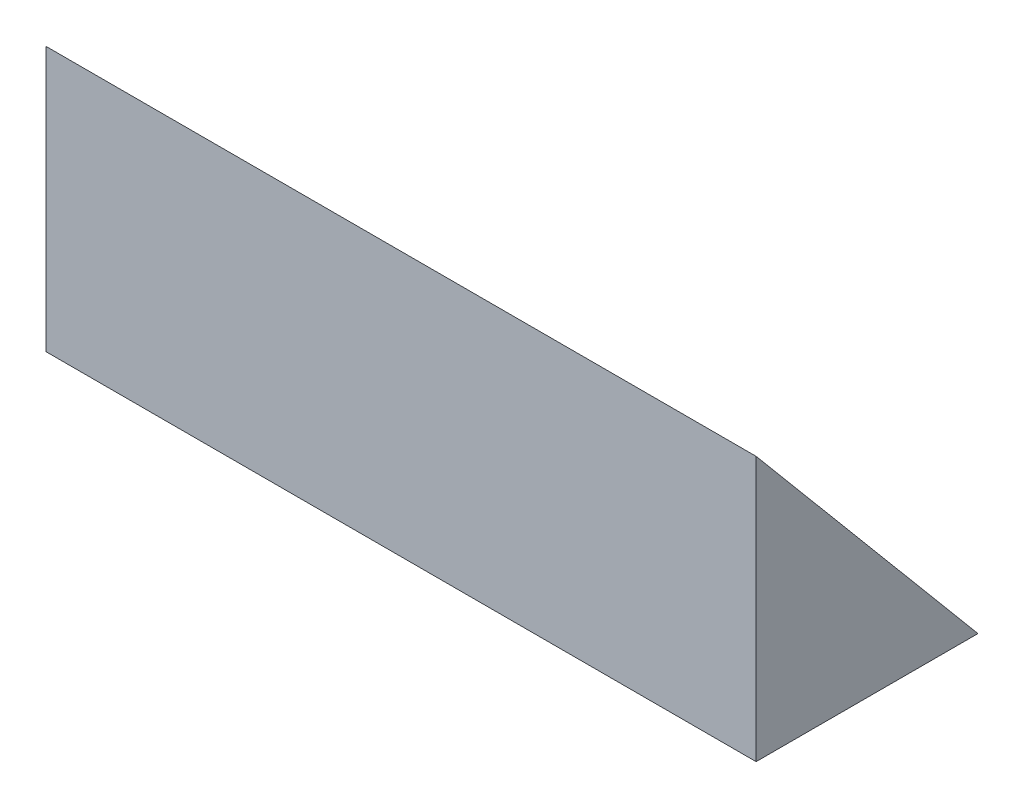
ISO-10303-21;
HEADER;
FILE_DESCRIPTION(('STEP AP214'),'2;1');
FILE_NAME('part.step','',(''),(''),'','','');
FILE_SCHEMA(('AUTOMOTIVE_DESIGN { 1 0 10303 214 1 1 1 1 }'));
ENDSEC;
DATA;
#1=APPLICATION_CONTEXT('core data for automotive mechanical design processes');
#2=APPLICATION_PROTOCOL_DEFINITION('international standard','automotive_design',2000,#1);
#3=PRODUCT_CONTEXT('',#1,'mechanical');
#4=PRODUCT('Part','Part','',(#3));
#5=PRODUCT_RELATED_PRODUCT_CATEGORY('part','',(#4));
#6=PRODUCT_DEFINITION_FORMATION('','',#4);
#7=PRODUCT_DEFINITION_CONTEXT('part definition',#1,'design');
#8=PRODUCT_DEFINITION('design','',#6,#7);
#9=PRODUCT_DEFINITION_SHAPE('','',#8);
#10=(LENGTH_UNIT() NAMED_UNIT(*) SI_UNIT(.MILLI.,.METRE.));
#11=(NAMED_UNIT(*) PLANE_ANGLE_UNIT() SI_UNIT($,.RADIAN.));
#12=(NAMED_UNIT(*) SI_UNIT($,.STERADIAN.) SOLID_ANGLE_UNIT());
#13=UNCERTAINTY_MEASURE_WITH_UNIT(LENGTH_MEASURE(1.E-05),#10,'distance_accuracy_value','');
#14=(GEOMETRIC_REPRESENTATION_CONTEXT(3) GLOBAL_UNCERTAINTY_ASSIGNED_CONTEXT((#13)) GLOBAL_UNIT_ASSIGNED_CONTEXT((#10,
#11,#12)) REPRESENTATION_CONTEXT('',''));
#15=CARTESIAN_POINT('',(0.,0.,0.));
#16=DIRECTION('',(0.,0.,1.));
#17=DIRECTION('',(1.,0.,0.));
#18=AXIS2_PLACEMENT_3D('',#15,#16,#17);
#19=CARTESIAN_POINT('',(1600.,0.,0.));
#20=DIRECTION('',(0.,0.,-1.));
#21=DIRECTION('',(-1.,0.,0.));
#22=AXIS2_PLACEMENT_3D('',#19,#20,#21);
#23=PLANE('',#22);
#24=DIRECTION('',(0.,-1.,0.));
#25=VECTOR('',#24,1.);
#26=CARTESIAN_POINT('',(0.,0.,0.));
#27=LINE('',#26,#25);
#28=CARTESIAN_POINT('',(0.,595.876796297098,0.));
#29=VERTEX_POINT('',#28);
#30=CARTESIAN_POINT('',(0.,0.,0.));
#31=VERTEX_POINT('',#30);
#32=EDGE_CURVE('E79',#29,#31,#27,.T.);
#33=ORIENTED_EDGE('',*,*,#32,.T.);
#34=DIRECTION('',(-1.,0.,0.));
#35=VECTOR('',#34,1.);
#36=CARTESIAN_POINT('',(1600.,0.,0.));
#37=LINE('',#36,#35);
#38=CARTESIAN_POINT('',(1600.,0.,0.));
#39=VERTEX_POINT('',#38);
#40=EDGE_CURVE('E11',#39,#31,#37,.T.);
#41=ORIENTED_EDGE('',*,*,#40,.F.);
#42=DIRECTION('',(0.,-1.,0.));
#43=VECTOR('',#42,1.);
#44=CARTESIAN_POINT('',(1600.,0.,0.));
#45=LINE('',#44,#43);
#46=CARTESIAN_POINT('',(1600.,595.876796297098,0.));
#47=VERTEX_POINT('',#46);
#48=EDGE_CURVE('E72',#47,#39,#45,.T.);
#49=ORIENTED_EDGE('',*,*,#48,.F.);
#50=DIRECTION('',(-1.,0.,0.));
#51=VECTOR('',#50,1.);
#52=CARTESIAN_POINT('',(1600.,595.876796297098,0.));
#53=LINE('',#52,#51);
#54=EDGE_CURVE('E80',#47,#29,#53,.T.);
#55=ORIENTED_EDGE('',*,*,#54,.T.);
#56=EDGE_LOOP('',(#33,#41,#49,#55));
#57=FACE_BOUND('',#56,.T.);
#58=ADVANCED_FACE('F32',(#57),#23,.F.);
#59=CARTESIAN_POINT('',(1600.,0.,0.));
#60=DIRECTION('',(0.,1.,0.));
#61=DIRECTION('',(0.,0.,1.));
#62=AXIS2_PLACEMENT_3D('',#59,#60,#61);
#63=PLANE('',#62);
#64=CARTESIAN_POINT('',(1050.,0.,-250.));
#65=DIRECTION('',(0.,-1.,0.));
#66=DIRECTION('',(0.,0.,1.));
#67=AXIS2_PLACEMENT_3D('',#64,#65,#66);
#68=CIRCLE('',#67,5.00000000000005);
#69=CARTESIAN_POINT('',(1050.,0.,-245.));
#70=VERTEX_POINT('',#69);
#71=EDGE_CURVE('E116',#70,#70,#68,.T.);
#72=ORIENTED_EDGE('',*,*,#71,.F.);
#73=EDGE_LOOP('',(#72));
#74=FACE_BOUND('',#73,.T.);
#75=CARTESIAN_POINT('',(550.,0.,-250.));
#76=DIRECTION('',(0.,-1.,0.));
#77=DIRECTION('',(0.,0.,-1.));
#78=AXIS2_PLACEMENT_3D('',#75,#76,#77);
#79=CIRCLE('',#78,5.00000000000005);
#80=CARTESIAN_POINT('',(550.,0.,-255.));
#81=VERTEX_POINT('',#80);
#82=EDGE_CURVE('E86',#81,#81,#79,.T.);
#83=ORIENTED_EDGE('',*,*,#82,.F.);
#84=EDGE_LOOP('',(#83));
#85=FACE_BOUND('',#84,.T.);
#86=DIRECTION('',(0.,0.,-1.));
#87=VECTOR('',#86,1.);
#88=CARTESIAN_POINT('',(0.,0.,0.));
#89=LINE('',#88,#87);
#90=CARTESIAN_POINT('',(0.,0.,-500.));
#91=VERTEX_POINT('',#90);
#92=EDGE_CURVE('E60',#31,#91,#89,.T.);
#93=ORIENTED_EDGE('',*,*,#92,.T.);
#94=DIRECTION('',(-1.,0.,0.));
#95=VECTOR('',#94,1.);
#96=CARTESIAN_POINT('',(1600.,0.,-500.));
#97=LINE('',#96,#95);
#98=CARTESIAN_POINT('',(1600.,0.,-500.));
#99=VERTEX_POINT('',#98);
#100=EDGE_CURVE('E40',#99,#91,#97,.T.);
#101=ORIENTED_EDGE('',*,*,#100,.F.);
#102=DIRECTION('',(0.,0.,-1.));
#103=VECTOR('',#102,1.);
#104=CARTESIAN_POINT('',(1600.,0.,0.));
#105=LINE('',#104,#103);
#106=EDGE_CURVE('E68',#39,#99,#105,.T.);
#107=ORIENTED_EDGE('',*,*,#106,.F.);
#108=ORIENTED_EDGE('',*,*,#40,.T.);
#109=EDGE_LOOP('',(#93,#101,#107,#108));
#110=FACE_BOUND('',#109,.T.);
#111=ADVANCED_FACE('F69',(#74,#85,#110),#63,.F.);
#112=CARTESIAN_POINT('',(1600.,0.,-500.));
#113=DIRECTION('',(0.,-0.642787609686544,0.766044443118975));
#114=DIRECTION('',(0.,-0.766044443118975,-0.642787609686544));
#115=AXIS2_PLACEMENT_3D('',#112,#113,#114);
#116=PLANE('',#115);
#117=DIRECTION('',(0.,0.766044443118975,0.642787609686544));
#118=VECTOR('',#117,1.);
#119=CARTESIAN_POINT('',(0.,0.,-500.));
#120=LINE('',#119,#118);
#121=EDGE_CURVE('E65',#91,#29,#120,.T.);
#122=ORIENTED_EDGE('',*,*,#121,.T.);
#123=ORIENTED_EDGE('',*,*,#54,.F.);
#124=DIRECTION('',(0.,0.766044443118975,0.642787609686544));
#125=VECTOR('',#124,1.);
#126=CARTESIAN_POINT('',(1600.,0.,-500.));
#127=LINE('',#126,#125);
#128=EDGE_CURVE('E48',#99,#47,#127,.T.);
#129=ORIENTED_EDGE('',*,*,#128,.F.);
#130=ORIENTED_EDGE('',*,*,#100,.T.);
#131=EDGE_LOOP('',(#122,#123,#129,#130));
#132=FACE_BOUND('',#131,.T.);
#133=ADVANCED_FACE('F91',(#132),#116,.F.);
#134=CARTESIAN_POINT('',(1600.,0.,0.));
#135=DIRECTION('',(-1.,0.,0.));
#136=DIRECTION('',(0.,0.,1.));
#137=AXIS2_PLACEMENT_3D('',#134,#135,#136);
#138=PLANE('',#137);
#139=ORIENTED_EDGE('',*,*,#48,.T.);
#140=ORIENTED_EDGE('',*,*,#106,.T.);
#141=ORIENTED_EDGE('',*,*,#128,.T.);
#142=EDGE_LOOP('',(#139,#140,#141));
#143=FACE_BOUND('',#142,.T.);
#144=ADVANCED_FACE('F75',(#143),#138,.F.);
#145=CARTESIAN_POINT('',(0.,0.,0.));
#146=DIRECTION('',(-1.,0.,0.));
#147=DIRECTION('',(0.,0.,1.));
#148=AXIS2_PLACEMENT_3D('',#145,#146,#147);
#149=PLANE('',#148);
#150=ORIENTED_EDGE('',*,*,#32,.F.);
#151=ORIENTED_EDGE('',*,*,#121,.F.);
#152=ORIENTED_EDGE('',*,*,#92,.F.);
#153=EDGE_LOOP('',(#150,#151,#152));
#154=FACE_BOUND('',#153,.T.);
#155=ADVANCED_FACE('F92',(#154),#149,.T.);
#156=CARTESIAN_POINT('',(550.,10.,-250.));
#157=DIRECTION('',(0.,-1.,0.));
#158=DIRECTION('',(0.,0.,-1.));
#159=AXIS2_PLACEMENT_3D('',#156,#157,#158);
#160=CYLINDRICAL_SURFACE('',#159,5.00000000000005);
#161=CARTESIAN_POINT('',(550.,10.,-250.));
#162=DIRECTION('',(0.,-1.,0.));
#163=DIRECTION('',(0.,0.,-1.));
#164=AXIS2_PLACEMENT_3D('',#161,#162,#163);
#165=CIRCLE('',#164,5.00000000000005);
#166=CARTESIAN_POINT('',(550.,10.,-255.));
#167=VERTEX_POINT('',#166);
#168=EDGE_CURVE('E82',#167,#167,#165,.T.);
#169=ORIENTED_EDGE('',*,*,#168,.F.);
#170=EDGE_LOOP('',(#169));
#171=FACE_BOUND('',#170,.T.);
#172=ORIENTED_EDGE('',*,*,#82,.T.);
#173=EDGE_LOOP('',(#172));
#174=FACE_BOUND('',#173,.T.);
#175=ADVANCED_FACE('F94',(#171,#174),#160,.F.);
#176=CARTESIAN_POINT('',(550.,10.,-250.));
#177=DIRECTION('',(0.,-1.,0.));
#178=DIRECTION('',(0.,0.,-1.));
#179=AXIS2_PLACEMENT_3D('',#176,#177,#178);
#180=PLANE('',#179);
#181=ORIENTED_EDGE('',*,*,#168,.T.);
#182=EDGE_LOOP('',(#181));
#183=FACE_BOUND('',#182,.T.);
#184=ADVANCED_FACE('F100',(#183),#180,.T.);
#185=CARTESIAN_POINT('',(1050.,10.,-250.));
#186=DIRECTION('',(0.,-1.,0.));
#187=DIRECTION('',(0.,0.,-1.));
#188=AXIS2_PLACEMENT_3D('',#185,#186,#187);
#189=CYLINDRICAL_SURFACE('',#188,5.00000000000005);
#190=CARTESIAN_POINT('',(1050.,10.,-250.));
#191=DIRECTION('',(0.,-1.,0.));
#192=DIRECTION('',(0.,0.,1.));
#193=AXIS2_PLACEMENT_3D('',#190,#191,#192);
#194=CIRCLE('',#193,5.00000000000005);
#195=CARTESIAN_POINT('',(1050.,10.,-245.));
#196=VERTEX_POINT('',#195);
#197=EDGE_CURVE('E120',#196,#196,#194,.T.);
#198=ORIENTED_EDGE('',*,*,#197,.F.);
#199=EDGE_LOOP('',(#198));
#200=FACE_BOUND('',#199,.T.);
#201=ORIENTED_EDGE('',*,*,#71,.T.);
#202=EDGE_LOOP('',(#201));
#203=FACE_BOUND('',#202,.T.);
#204=ADVANCED_FACE('F126',(#200,#203),#189,.F.);
#205=CARTESIAN_POINT('',(1050.,10.,-250.));
#206=DIRECTION('',(0.,1.,0.));
#207=DIRECTION('',(0.,0.,1.));
#208=AXIS2_PLACEMENT_3D('',#205,#206,#207);
#209=PLANE('',#208);
#210=ORIENTED_EDGE('',*,*,#197,.T.);
#211=EDGE_LOOP('',(#210));
#212=FACE_BOUND('',#211,.T.);
#213=ADVANCED_FACE('F128',(#212),#209,.F.);
#214=CLOSED_SHELL('',(#58,#111,#133,#144,#155,#175,#184,#204,#213));
#215=MANIFOLD_SOLID_BREP('B2',#214);
#216=ADVANCED_BREP_SHAPE_REPRESENTATION('',(#18,#215),#14);
#217=SHAPE_DEFINITION_REPRESENTATION(#9,#216);
ENDSEC;
END-ISO-10303-21;
